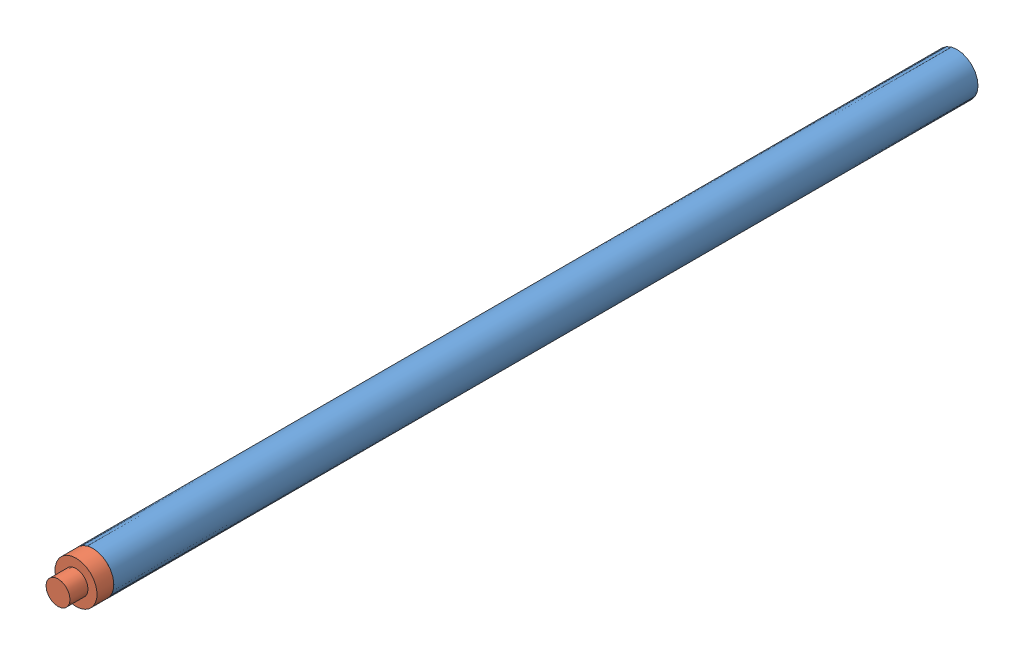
SolidWorks assembly Boom Sub Assembly.SLDASM, configuration Default (file format 4700). Lengths in mm.
Overall size (31.05 31.05 475.62).
2 component instances, 2 part files, 2 mates.
Components (placement in the parent):
- Boom-1: Boom.SLDPRT [Default] at origin size (22.23 22.23 457.2)
- Swivel Adapter-1: Swivel Adapter.SLDPRT [Default] at (0 0 8.89) x (0.808636 -0.588309 0) z (0 0 1) size (22.23 22.23 28.58)
Mates (geometry in assembly coordinates):
- Concentric1: concentric aligned: cylinder of Boom-1 through (0 0 -457.2) axis (0 0 1) radius 9.525; cylinder of Swivel Adapter-1 through (0 0 -10.16) axis (0 0 1) radius 9.525
- Coincident1: coincident anti-aligned: plane of Boom-1 through (0 0 0) normal (0 0 1); plane of Swivel Adapter-1 through (0 0 0) normal (0 0 -1)
